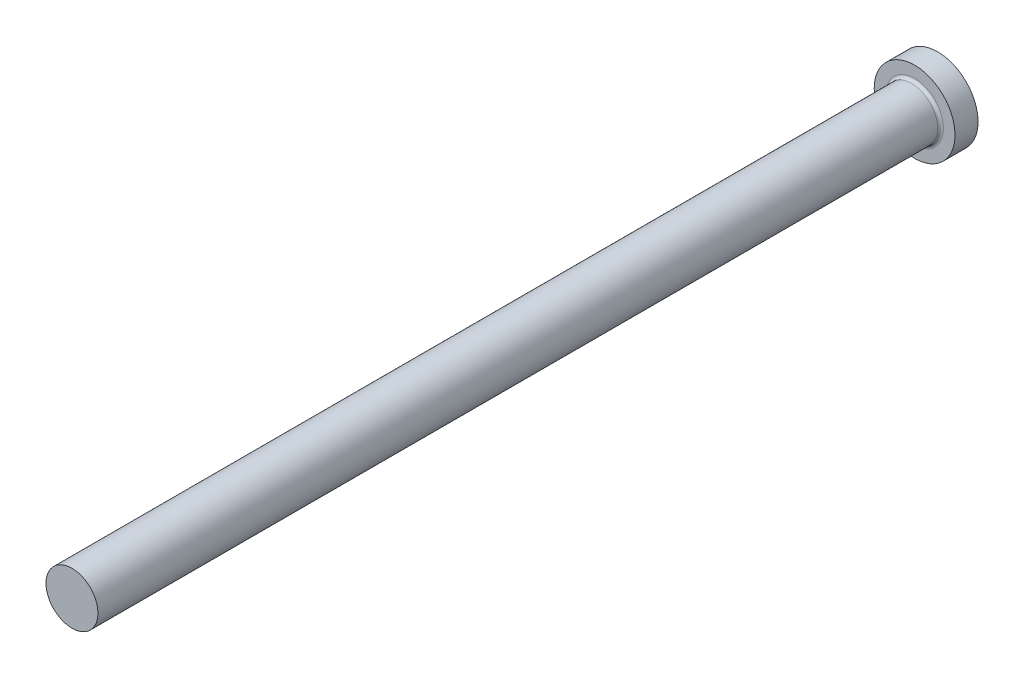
from build123d import *

# Parameters (mm, degrees)
FILLET1_R = 0.5


with BuildPart() as part:
    # FV → Revolve1 (revolve)
    with BuildSketch(Plane(origin=(0, 0, 0), x_dir=(1, 0, 0), z_dir=(0, 1, 0)), mode=Mode.PRIVATE) as revolve1_sk:
        Polygon((0, 0), (7, 0), (7, -4), (4.5, -4), (4.5, -150), (0, -150), align=None)
    revolve(revolve1_sk.sketch.rotate(Axis((0, 0, -9.033228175), (0, 0, 1)), 180), axis=Axis((0, 0, -9.033228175), (0, 0, 1)))

    # Fillet1
    fillet1_edges = [part.edges().sort_by_distance(p)[0] for p in [
        (4.5, 0, 4),
    ]]
    fillet(fillet1_edges, radius=FILLET1_R)


solid = part.part
